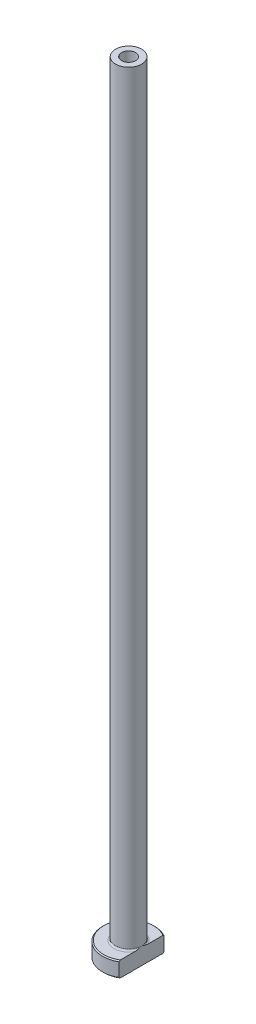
from build123d import *

# Parameters (mm, degrees)
FILLET1_R          = 0.3
CHAMFER1_SIZE      = 0.2
CUT_EXTRUDE1_DEPTH = 151.166574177
CHAMFER2_SIZE      = 0.5


with BuildPart() as part:
    # Sketch1 → Revolve1 (revolve)
    with BuildSketch(Plane.XY, mode=Mode.PRIVATE) as revolve1_sk:
        Polygon((-1.35, 150), (-2.5, 150), (-2.5, 3), (-5, 3), (-5, 0), (-1.6, 0), (-1.6, 93), (-1.35, 105), align=None)
    revolve(revolve1_sk.sketch.rotate(Axis((0, 92.187680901, 0), (0, -1, 0)), 270), axis=Axis((0, 92.187680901, 0), (0, -1, 0)))

    # Fillet1
    fillet1_edges = [part.edges().sort_by_distance(p)[0] for p in [
        (0, 3, -2.5),
    ]]
    fillet(fillet1_edges, radius=FILLET1_R)

    # Chamfer1
    chamfer1_edges = [part.edges().sort_by_distance(p)[0] for p in [
        (0, 0, -5),
        (0, 3, -5),
    ]]
    chamfer(chamfer1_edges, length=CHAMFER1_SIZE)

    # Sketch2 → Cut-Extrude1 (cut, through all)
    with BuildSketch(Plane.XZ):
        with BuildLine():
            Line((2.5, 4.330127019), (2.5, -4.330127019))
            ThreePointArc((2.5, -4.330127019), (5, 0), (2.5, 4.330127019))
        make_face()
    extrude(amount=-CUT_EXTRUDE1_DEPTH, mode=Mode.SUBTRACT)

    # Chamfer2
    chamfer2_edges = [part.edges().sort_by_distance(p)[0] for p in [
        (0, 0, -1.6),
    ]]
    chamfer(chamfer2_edges, length=CHAMFER2_SIZE)


solid = part.part
